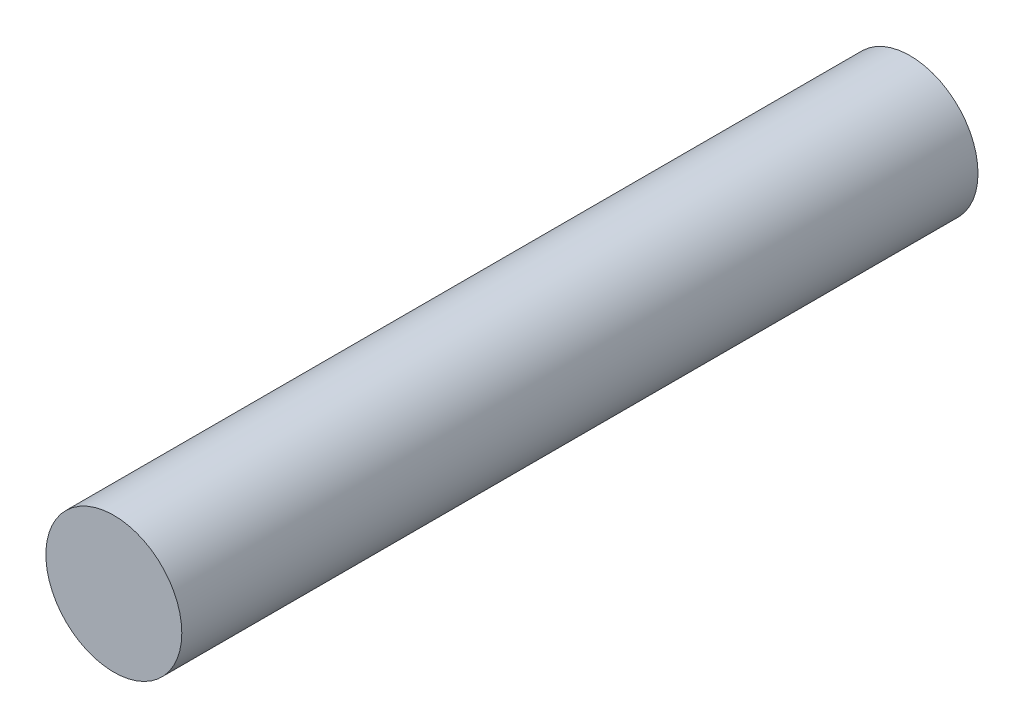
from build123d import *

# Parameters (mm, degrees)
SKETCH1_R           = 7
BOSS_EXTRUDE1_DEPTH = 82


with BuildPart() as part:
    # Sketch1 → Boss-Extrude1 (new body)
    with BuildSketch(Plane.XY):
        Circle(SKETCH1_R)
    extrude(amount=BOSS_EXTRUDE1_DEPTH)


solid = part.part
